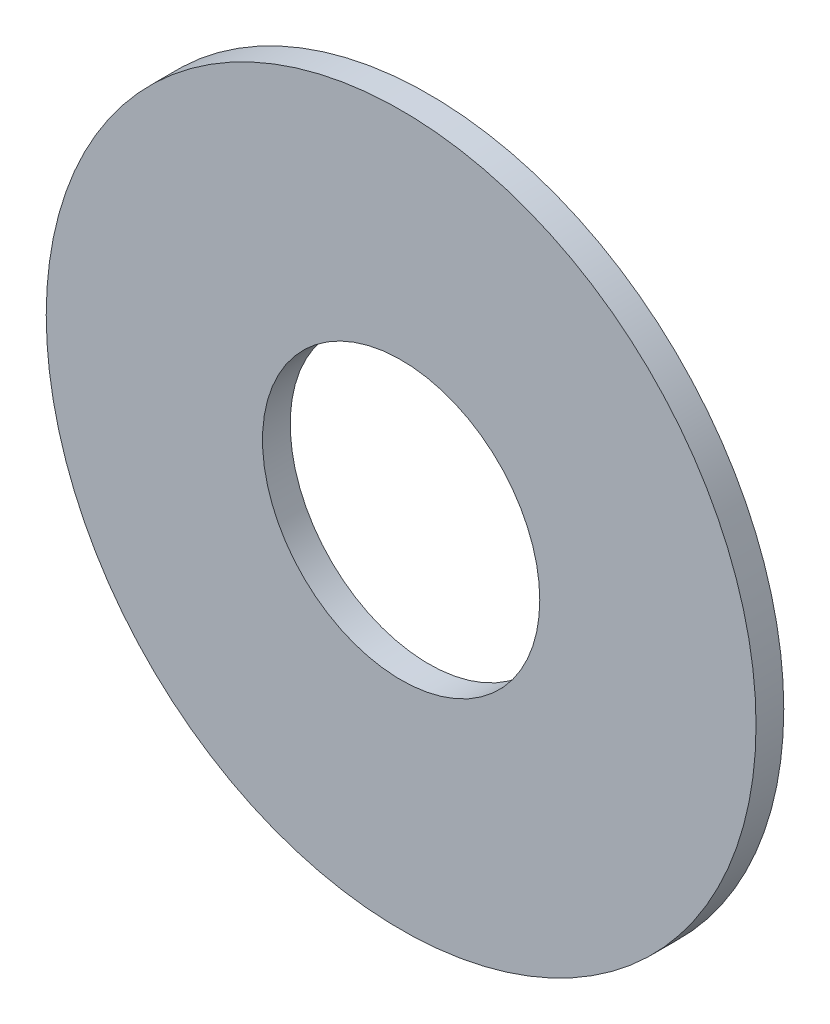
ISO-10303-21;
HEADER;
FILE_DESCRIPTION(('STEP AP214'),'2;1');
FILE_NAME('part.step','',(''),(''),'','','');
FILE_SCHEMA(('AUTOMOTIVE_DESIGN { 1 0 10303 214 1 1 1 1 }'));
ENDSEC;
DATA;
#1=APPLICATION_CONTEXT('core data for automotive mechanical design processes');
#2=APPLICATION_PROTOCOL_DEFINITION('international standard','automotive_design',2000,#1);
#3=PRODUCT_CONTEXT('',#1,'mechanical');
#4=PRODUCT('Part','Part','',(#3));
#5=PRODUCT_RELATED_PRODUCT_CATEGORY('part','',(#4));
#6=PRODUCT_DEFINITION_FORMATION('','',#4);
#7=PRODUCT_DEFINITION_CONTEXT('part definition',#1,'design');
#8=PRODUCT_DEFINITION('design','',#6,#7);
#9=PRODUCT_DEFINITION_SHAPE('','',#8);
#10=(LENGTH_UNIT() NAMED_UNIT(*) SI_UNIT(.MILLI.,.METRE.));
#11=(NAMED_UNIT(*) PLANE_ANGLE_UNIT() SI_UNIT($,.RADIAN.));
#12=(NAMED_UNIT(*) SI_UNIT($,.STERADIAN.) SOLID_ANGLE_UNIT());
#13=UNCERTAINTY_MEASURE_WITH_UNIT(LENGTH_MEASURE(1.E-05),#10,'distance_accuracy_value','');
#14=(GEOMETRIC_REPRESENTATION_CONTEXT(3) GLOBAL_UNCERTAINTY_ASSIGNED_CONTEXT((#13)) GLOBAL_UNIT_ASSIGNED_CONTEXT((#10,
#11,#12)) REPRESENTATION_CONTEXT('',''));
#15=CARTESIAN_POINT('',(0.,0.,0.));
#16=DIRECTION('',(0.,0.,1.));
#17=DIRECTION('',(1.,0.,0.));
#18=AXIS2_PLACEMENT_3D('',#15,#16,#17);
#19=CARTESIAN_POINT('',(0.,0.,5.));
#20=DIRECTION('',(0.,0.,1.));
#21=DIRECTION('',(1.,0.,0.));
#22=AXIS2_PLACEMENT_3D('',#19,#20,#21);
#23=PLANE('',#22);
#24=CARTESIAN_POINT('',(0.,0.,5.));
#25=DIRECTION('',(0.,0.,1.));
#26=DIRECTION('',(1.,0.,0.));
#27=AXIS2_PLACEMENT_3D('',#24,#25,#26);
#28=CIRCLE('',#27,64.);
#29=CARTESIAN_POINT('',(64.,0.,5.));
#30=VERTEX_POINT('',#29);
#31=EDGE_CURVE('E10',#30,#30,#28,.T.);
#32=ORIENTED_EDGE('',*,*,#31,.T.);
#33=EDGE_LOOP('',(#32));
#34=FACE_BOUND('',#33,.T.);
#35=CARTESIAN_POINT('',(0.,0.,5.));
#36=DIRECTION('',(0.,0.,1.));
#37=DIRECTION('',(1.,0.,0.));
#38=AXIS2_PLACEMENT_3D('',#35,#36,#37);
#39=CIRCLE('',#38,25.);
#40=CARTESIAN_POINT('',(25.,0.,5.));
#41=VERTEX_POINT('',#40);
#42=EDGE_CURVE('E41',#41,#41,#39,.T.);
#43=ORIENTED_EDGE('',*,*,#42,.F.);
#44=EDGE_LOOP('',(#43));
#45=FACE_BOUND('',#44,.T.);
#46=ADVANCED_FACE('F30',(#34,#45),#23,.T.);
#47=CARTESIAN_POINT('',(0.,0.,0.));
#48=DIRECTION('',(0.,0.,1.));
#49=DIRECTION('',(1.,0.,0.));
#50=AXIS2_PLACEMENT_3D('',#47,#48,#49);
#51=PLANE('',#50);
#52=CARTESIAN_POINT('',(0.,0.,0.));
#53=DIRECTION('',(0.,0.,1.));
#54=DIRECTION('',(1.,0.,0.));
#55=AXIS2_PLACEMENT_3D('',#52,#53,#54);
#56=CIRCLE('',#55,64.);
#57=CARTESIAN_POINT('',(64.,0.,0.));
#58=VERTEX_POINT('',#57);
#59=EDGE_CURVE('E34',#58,#58,#56,.T.);
#60=ORIENTED_EDGE('',*,*,#59,.F.);
#61=EDGE_LOOP('',(#60));
#62=FACE_BOUND('',#61,.T.);
#63=CARTESIAN_POINT('',(0.,0.,0.));
#64=DIRECTION('',(0.,0.,1.));
#65=DIRECTION('',(1.,0.,0.));
#66=AXIS2_PLACEMENT_3D('',#63,#64,#65);
#67=CIRCLE('',#66,25.);
#68=CARTESIAN_POINT('',(25.,0.,0.));
#69=VERTEX_POINT('',#68);
#70=EDGE_CURVE('E43',#69,#69,#67,.T.);
#71=ORIENTED_EDGE('',*,*,#70,.T.);
#72=EDGE_LOOP('',(#71));
#73=FACE_BOUND('',#72,.T.);
#74=ADVANCED_FACE('F53',(#62,#73),#51,.F.);
#75=CARTESIAN_POINT('',(0.,0.,5.));
#76=DIRECTION('',(0.,0.,-1.));
#77=DIRECTION('',(-1.,0.,0.));
#78=AXIS2_PLACEMENT_3D('',#75,#76,#77);
#79=CYLINDRICAL_SURFACE('',#78,64.);
#80=ORIENTED_EDGE('',*,*,#31,.F.);
#81=EDGE_LOOP('',(#80));
#82=FACE_BOUND('',#81,.T.);
#83=ORIENTED_EDGE('',*,*,#59,.T.);
#84=EDGE_LOOP('',(#83));
#85=FACE_BOUND('',#84,.T.);
#86=ADVANCED_FACE('F32',(#82,#85),#79,.T.);
#87=CARTESIAN_POINT('',(0.,0.,5.));
#88=DIRECTION('',(0.,0.,-1.));
#89=DIRECTION('',(-1.,0.,0.));
#90=AXIS2_PLACEMENT_3D('',#87,#88,#89);
#91=CYLINDRICAL_SURFACE('',#90,25.);
#92=ORIENTED_EDGE('',*,*,#42,.T.);
#93=EDGE_LOOP('',(#92));
#94=FACE_BOUND('',#93,.T.);
#95=ORIENTED_EDGE('',*,*,#70,.F.);
#96=EDGE_LOOP('',(#95));
#97=FACE_BOUND('',#96,.T.);
#98=ADVANCED_FACE('F49',(#94,#97),#91,.F.);
#99=CLOSED_SHELL('',(#46,#74,#86,#98));
#100=MANIFOLD_SOLID_BREP('B2',#99);
#101=ADVANCED_BREP_SHAPE_REPRESENTATION('',(#18,#100),#14);
#102=SHAPE_DEFINITION_REPRESENTATION(#9,#101);
ENDSEC;
END-ISO-10303-21;
